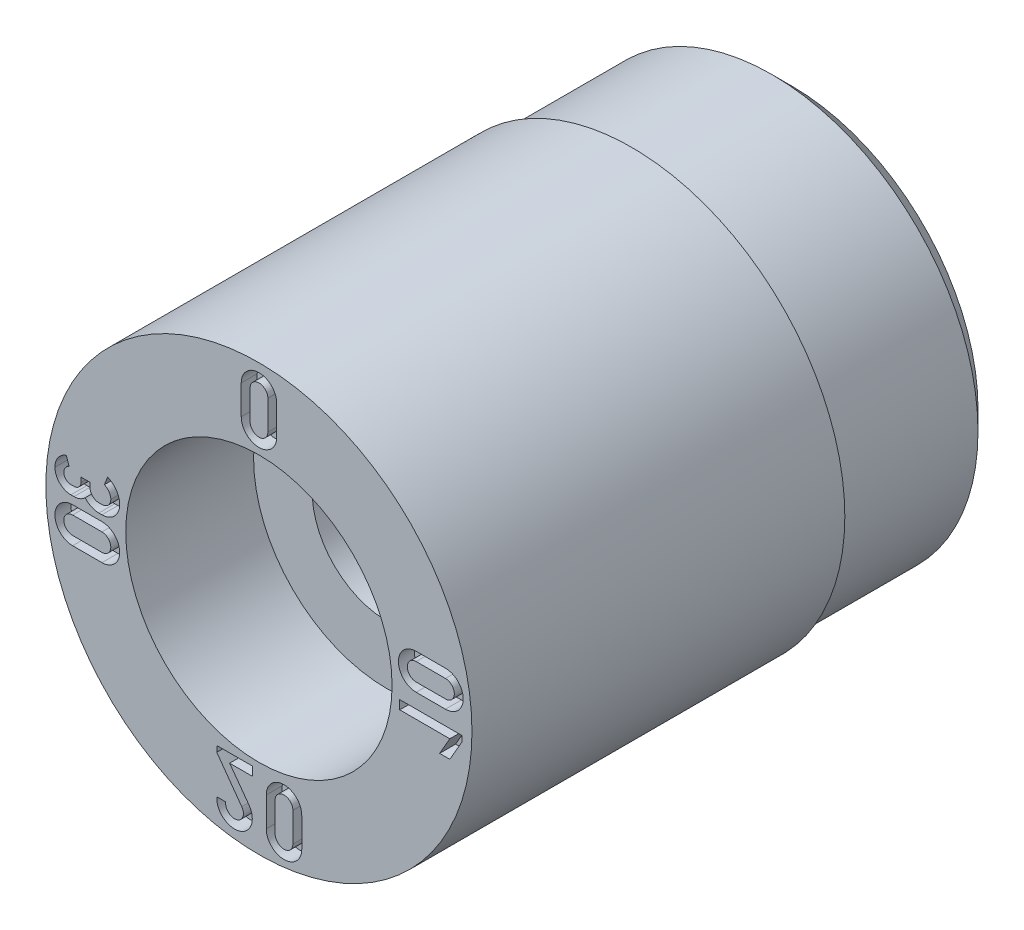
from build123d import *

# Parameters (mm, degrees)
SKETCH5_W          = 1.5
SKETCH5_H          = 1
CUT_EXTRUDE1_DEPTH = 0.15


with BuildPart() as part:
    # Sketch1 → Revolve1 (revolve)
    with BuildSketch(Plane(origin=(0, 0, 0), x_dir=(0, 0, -1), z_dir=(1, 0, 0)), mode=Mode.PRIVATE) as revolve1_sk:
        Polygon((0, 2), (0, 1.25), (1.2, 1.25), (1.2, 0.7), (5, 0.7), (5, 1.75), (4.75, 2), align=None)
    revolve(revolve1_sk.sketch.rotate(Axis((0, 0, 3.797909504), (0, 0, -1)), 90), axis=Axis((0, 0, 3.797909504), (0, 0, -1)))

    # Sketch5 → Cut-Revolve1 (revolve, cut)
    with BuildSketch(Plane(origin=(0, 0, 0), x_dir=(0, 0, -1), z_dir=(1, 0, 0)), mode=Mode.PRIVATE) as cut_revolve1_sk:
        with Locations((4.25, 2.435)):
            Rectangle(SKETCH5_W, SKETCH5_H)
    revolve(cut_revolve1_sk.sketch.rotate(Axis((0, 0, 0), (0, 0, -1)), 90), axis=Axis((0, 0, 0), (0, 0, -1)), mode=Mode.SUBTRACT)

    # Sketch2 → Cut-Extrude1 (cut)
    # profile 1 of 7: a face of its own
    with BuildSketch(Plane.XY):
        with BuildLine():
            Line((-1.748476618, -0.029547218), (-1.47356337, -0.029570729))
            ThreePointArc((-1.47356337, -0.029570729), (-1.306933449, -0.196222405), (-1.473585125, -0.362852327))
            Line((-1.473585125, -0.362852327), (-1.748505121, -0.362828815))
            ThreePointArc((-1.748505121, -0.362828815), (-1.915131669, -0.196173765), (-1.748476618, -0.029547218))
        make_face()
        with BuildLine():
            Line((-1.473574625, -0.279555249), (-1.748497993, -0.27948509))
            ThreePointArc((-1.748497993, -0.27948509), (-1.831787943, -0.196180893), (-1.748483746, -0.112890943))
            Line((-1.748483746, -0.112890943), (-1.473557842, -0.112867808))
            ThreePointArc((-1.473557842, -0.112867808), (-1.390230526, -0.196219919), (-1.473574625, -0.279555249))
        make_face(mode=Mode.SUBTRACT)
    # profile 2 of 7: a face of its own
    with BuildSketch(Plane.XY):
        with BuildLine():
            Line((-0.165929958, 1.75219415), (-0.165906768, 1.477280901))
            ThreePointArc((-0.165906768, 1.477280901), (0.000744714, 1.310641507), (0.16737483, 1.477302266))
            Line((0.16737483, 1.477302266), (0.167398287, 1.752222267))
            ThreePointArc((0.167398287, 1.752222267), (0.000720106, 1.918872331), (-0.165929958, 1.75219415))
        make_face()
        with BuildLine():
            Line((0.084054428, 1.477295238), (0.084031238, 1.752215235))
            ThreePointArc((0.084031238, 1.752215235), (0.000727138, 1.835505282), (-0.082562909, 1.752201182))
            Line((-0.082562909, 1.752201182), (-0.082586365, 1.477275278))
            ThreePointArc((-0.082586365, 1.477275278), (0.000744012, 1.39396191), (0.084054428, 1.477295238))
        make_face(mode=Mode.SUBTRACT)
    # profile 3 of 7: a face of its own
    with BuildSketch(Plane.XY):
        with BuildLine():
            Line((-0.06216756, -1.393564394), (-0.062174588, -1.310242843))
            Line((-0.062174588, -1.310242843), (-0.395409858, -1.310270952))
            Line((-0.395409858, -1.310270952), (-0.395405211, -1.365366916))
            Line((-0.395405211, -1.365366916), (-0.161114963, -1.69058129))
            ThreePointArc((-0.161114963, -1.69058129), (-0.209171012, -1.820292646), (-0.311114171, -1.726793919))
            Line((-0.311114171, -1.726793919), (-0.394908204, -1.726802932))
            ThreePointArc((-0.394908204, -1.726802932), (-0.183457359, -1.899630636), (-0.09341025, -1.64180823))
            Line((-0.09341025, -1.64180823), (-0.274620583, -1.393582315))
            Line((-0.274620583, -1.393582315), (-0.06216756, -1.393564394))
        make_face()
    # profile 4 of 7: a face of its own
    with BuildSketch(Plane.XY):
        Polygon((1.904730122, -0.078454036), (1.904734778, -0.133293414), (1.792576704, -0.328378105), (1.696496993, -0.328386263), (1.79225932, -0.161760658), (1.321587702, -0.161800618), (1.32158063, -0.078503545), align=None)
    # profile 5 of 7: a face of its own
    with BuildSketch(Plane.XY):
        with BuildLine():
            Line((1.751162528, 0.39132351), (1.476249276, 0.391346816))
            ThreePointArc((1.476249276, 0.391346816), (1.309609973, 0.224695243), (1.476270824, 0.058065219))
            Line((1.476270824, 0.058065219), (1.75119082, 0.05808856))
            ThreePointArc((1.75119082, 0.05808856), (1.917794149, 0.224720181), (1.751162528, 0.39132351))
        make_face()
        with BuildLine():
            Line((1.47626375, 0.141385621), (1.751183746, 0.141408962))
            ThreePointArc((1.751183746, 0.141408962), (1.834473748, 0.224713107), (1.751169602, 0.308003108))
            Line((1.751169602, 0.308003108), (1.476243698, 0.308026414))
            ThreePointArc((1.476243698, 0.308026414), (1.392930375, 0.224695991), (1.47626375, 0.141385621))
        make_face(mode=Mode.SUBTRACT)
    # profile 6 of 7: a face of its own
    with BuildSketch(Plane.XY):
        with BuildLine():
            Line((-1.473361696, 0.109387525), (-1.502519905, 0.109390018))
            ThreePointArc((-1.502519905, 0.109390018), (-1.561410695, 0.133789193), (-1.5857999, 0.192684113))
            Line((-1.5857999, 0.192684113), (-1.585796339, 0.234331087))
            Line((-1.585796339, 0.234331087), (-1.669116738, 0.234338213))
            Line((-1.669116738, 0.234338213), (-1.669120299, 0.192701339))
            ThreePointArc((-1.669120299, 0.192701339), (-1.688643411, 0.145579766), (-1.735768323, 0.126064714))
            Line((-1.735768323, 0.126064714), (-1.764922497, 0.126067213))
            ThreePointArc((-1.764922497, 0.126067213), (-1.812027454, 0.145606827), (-1.831562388, 0.192713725))
            ThreePointArc((-1.831562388, 0.192713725), (-1.817517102, 0.236437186), (-1.780588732, 0.26373749))
            Line((-1.780588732, 0.26373749), (-1.807243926, 0.342675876))
            ThreePointArc((-1.807243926, 0.342675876), (-1.885167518, 0.285010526), (-1.914872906, 0.192733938))
            ThreePointArc((-1.914872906, 0.192733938), (-1.870968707, 0.086676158), (-1.764921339, 0.042746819))
            Line((-1.764921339, 0.042746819), (-1.735775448, 0.042744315))
            ThreePointArc((-1.735775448, 0.042744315), (-1.678857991, 0.053965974), (-1.630464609, 0.085959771))
            ThreePointArc((-1.630464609, 0.085959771), (-1.573158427, 0.041777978), (-1.502523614, 0.026069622))
            Line((-1.502523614, 0.026069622), (-1.473354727, 0.026067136))
            ThreePointArc((-1.473354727, 0.026067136), (-1.355545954, 0.07485816), (-1.306751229, 0.192665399))
            ThreePointArc((-1.306751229, 0.192665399), (-1.337782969, 0.293434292), (-1.420119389, 0.359298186))
            Line((-1.420119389, 0.359298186), (-1.450692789, 0.281826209))
            ThreePointArc((-1.450692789, 0.281826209), (-1.406644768, 0.246594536), (-1.390048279, 0.192686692))
            ThreePointArc((-1.390048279, 0.192686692), (-1.414453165, 0.133782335), (-1.473361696, 0.109387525))
        make_face()
    # profile 7 of 7: a face of its own
    with BuildSketch(Plane.XY):
        with BuildLine():
            Line((0.402231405, -1.755044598), (0.402254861, -1.480121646))
            ThreePointArc((0.402254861, -1.480121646), (0.23560338, -1.313494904), (0.068973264, -1.48014301))
            Line((0.068973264, -1.48014301), (0.068996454, -1.755063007))
            ThreePointArc((0.068996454, -1.755063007), (0.235623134, -1.921676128), (0.402231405, -1.755044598))
        make_face()
        with BuildLine():
            Line((0.152293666, -1.480145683), (0.152316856, -1.755065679))
            ThreePointArc((0.152316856, -1.755065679), (0.235620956, -1.838355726), (0.318911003, -1.755051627))
            Line((0.318911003, -1.755051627), (0.318934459, -1.480125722))
            ThreePointArc((0.318934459, -1.480125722), (0.235604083, -1.396815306), (0.152293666, -1.480145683))
        make_face(mode=Mode.SUBTRACT)
    extrude(amount=-CUT_EXTRUDE1_DEPTH, mode=Mode.SUBTRACT)


solid = part.part
